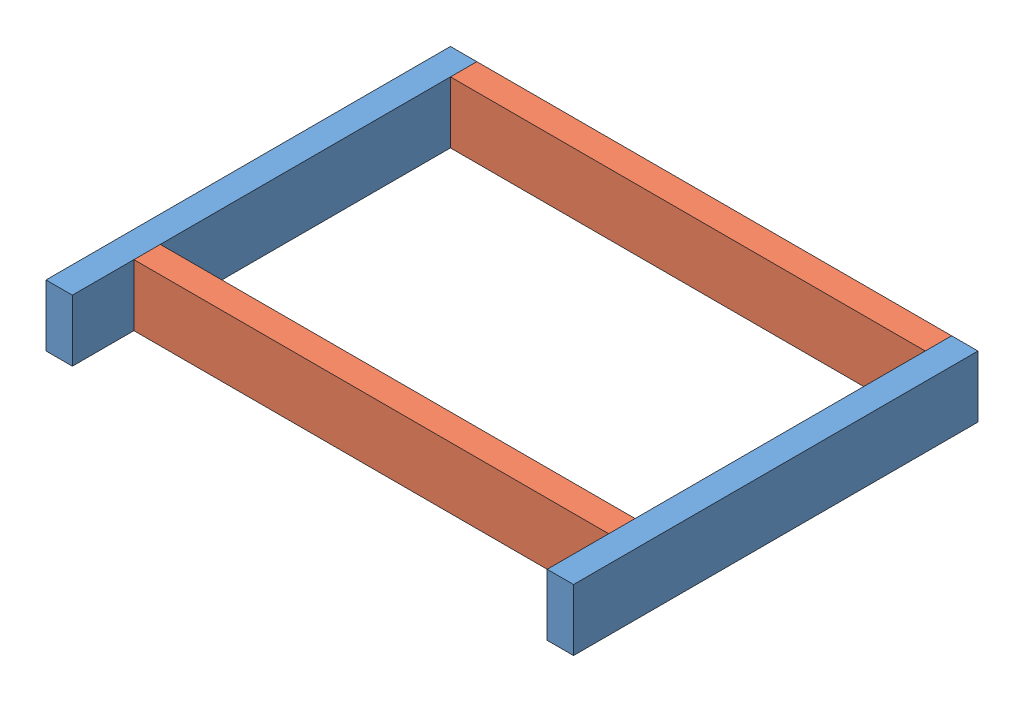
SolidWorks assembly TE-25001.SLDASM, configuration Default (file format 15000). Lengths in mm.
Overall size (762 88.9 584.2).
4 component instances, 2 part files, 9 mates.
Components (placement in the parent):
- TE-25002-1: TE-25002.SLDPRT [Default] at (269.5768 30.5461 -245.3447) x (0 0 1) z (-1 0 0) size (584.2 88.9 38.1)
- TE-25002-2: TE-25002.SLDPRT [Default] at (993.4768 30.5461 -245.3447) x (0 0 1) z (-1 0 0) size (584.2 88.9 38.1)
- TE-25003-1: TE-25003.SLDPRT [Default] at (288.6268 30.5461 230.9053) size (685.8 88.9 38.1)
- TE-25003-2: TE-25003.SLDPRT [Default] at (288.6268 30.5461 -226.2947) size (685.8 88.9 38.1)
Mates (geometry in assembly coordinates):
- Distance1: distance = 88.9 mm aligned: plane of Floor Rail Depth-1 through (269.5768 30.5461 338.8553) normal (0 0 1); plane of TE-25003-1 through (974.4268 -13.9039 249.9553) normal (0 0 1)
- Coincident11: coincident anti-aligned: plane of Floor Rail Depth-1 through (288.6268 -13.9039 338.8553) normal (1 0 0); plane of TE-25003-1 through (288.6268 30.5461 230.9053) normal (-1 0 0)
- Coincident12: coincident aligned: plane of Floor Rail Depth-1 through (250.5268 -13.9039 338.8553) normal (0 -1 0); plane of TE-25003-1 through (974.4268 -13.9039 249.9553) normal (0 -1 0)
- Coincident13: coincident aligned: plane of TE-25002-2 through (974.4268 -13.9039 338.8553) normal (0 -1 0); plane of TE-25003-1 through (974.4268 -13.9039 249.9553) normal (0 -1 0)
- Coincident14: coincident anti-aligned: plane of TE-25002-2 through (974.4268 -13.9039 338.8553) normal (-1 0 0); plane of TE-25003-1 through (974.4268 30.5461 230.9053) normal (1 0 0)
- Distance2: distance = 88.9 mm aligned: plane of Floor Rail Depth-2 through (993.4768 30.5461 338.8553) normal (0 0 1); plane of TE-25003-1 through (974.4268 -13.9039 249.9553) normal (0 0 1)
- Coincident16: coincident anti-aligned: plane of TE-25002-2 through (974.4268 -13.9039 338.8553) normal (-1 0 0); plane of TE-25003-2 through (974.4268 30.5461 -226.2947) normal (1 0 0)
- Coincident17: coincident aligned: plane of TE-25002-2 through (974.4268 74.9961 338.8553) normal (0 1 0); plane of TE-25003-2 through (974.4268 74.9961 -207.2447) normal (0 1 0)
- Coincident18: coincident aligned: plane of TE-25002-2 through (993.4768 30.5461 -245.3447) normal (0 0 -1); plane of TE-25003-2 through (974.4268 -13.9039 -245.3447) normal (0 0 -1)
